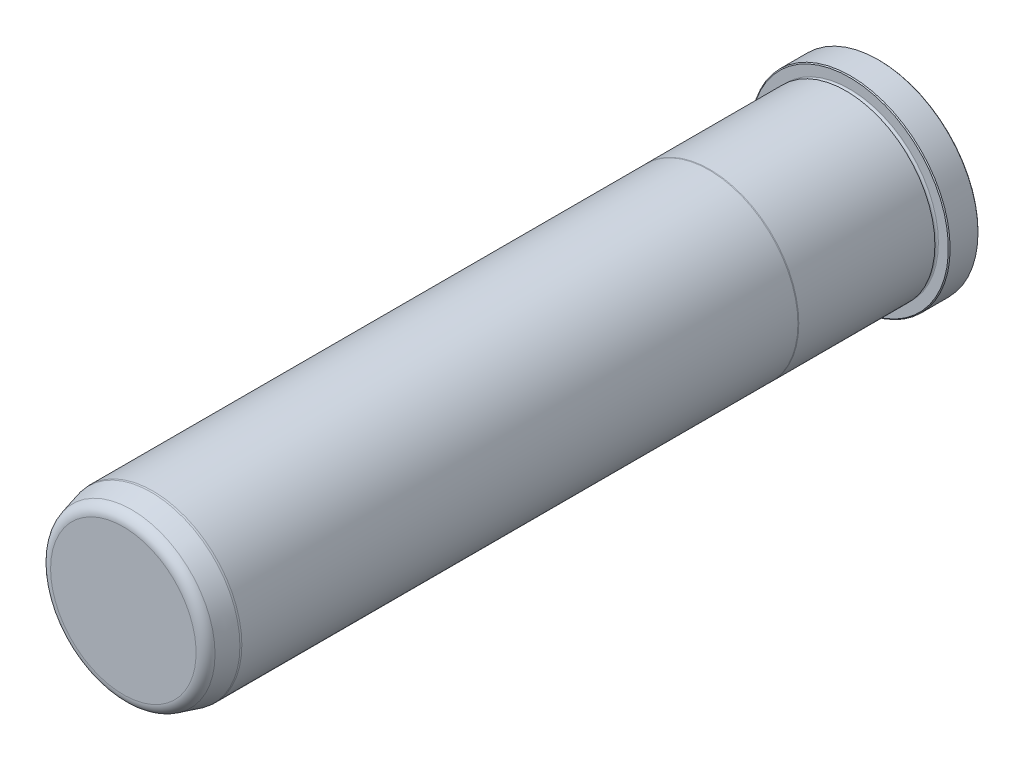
ISO-10303-21;
HEADER;
FILE_DESCRIPTION(('STEP AP214'),'2;1');
FILE_NAME('part.step','',(''),(''),'','','');
FILE_SCHEMA(('AUTOMOTIVE_DESIGN { 1 0 10303 214 1 1 1 1 }'));
ENDSEC;
DATA;
#1=APPLICATION_CONTEXT('core data for automotive mechanical design processes');
#2=APPLICATION_PROTOCOL_DEFINITION('international standard','automotive_design',2000,#1);
#3=PRODUCT_CONTEXT('',#1,'mechanical');
#4=PRODUCT('Part','Part','',(#3));
#5=PRODUCT_RELATED_PRODUCT_CATEGORY('part','',(#4));
#6=PRODUCT_DEFINITION_FORMATION('','',#4);
#7=PRODUCT_DEFINITION_CONTEXT('part definition',#1,'design');
#8=PRODUCT_DEFINITION('design','',#6,#7);
#9=PRODUCT_DEFINITION_SHAPE('','',#8);
#10=(LENGTH_UNIT() NAMED_UNIT(*) SI_UNIT(.MILLI.,.METRE.));
#11=(NAMED_UNIT(*) PLANE_ANGLE_UNIT() SI_UNIT($,.RADIAN.));
#12=(NAMED_UNIT(*) SI_UNIT($,.STERADIAN.) SOLID_ANGLE_UNIT());
#13=UNCERTAINTY_MEASURE_WITH_UNIT(LENGTH_MEASURE(1.E-05),#10,'distance_accuracy_value','');
#14=(GEOMETRIC_REPRESENTATION_CONTEXT(3) GLOBAL_UNCERTAINTY_ASSIGNED_CONTEXT((#13)) GLOBAL_UNIT_ASSIGNED_CONTEXT((#10,
#11,#12)) REPRESENTATION_CONTEXT('',''));
#15=CARTESIAN_POINT('',(0.,0.,0.));
#16=DIRECTION('',(0.,0.,1.));
#17=DIRECTION('',(1.,0.,0.));
#18=AXIS2_PLACEMENT_3D('',#15,#16,#17);
#19=CARTESIAN_POINT('',(0.,0.,0.));
#20=DIRECTION('',(0.,0.,1.));
#21=DIRECTION('',(1.,0.,0.));
#22=AXIS2_PLACEMENT_3D('',#19,#20,#21);
#23=PLANE('',#22);
#24=CARTESIAN_POINT('',(0.,0.,0.));
#25=DIRECTION('',(0.,0.,1.));
#26=DIRECTION('',(1.,0.,0.));
#27=AXIS2_PLACEMENT_3D('',#24,#25,#26);
#28=CIRCLE('',#27,42.3545);
#29=CARTESIAN_POINT('',(42.3545,0.,0.));
#30=VERTEX_POINT('',#29);
#31=EDGE_CURVE('E37',#30,#30,#28,.F.);
#32=ORIENTED_EDGE('',*,*,#31,.T.);
#33=EDGE_LOOP('',(#32));
#34=FACE_BOUND('',#33,.T.);
#35=ADVANCED_FACE('F30',(#34),#23,.F.);
#36=CARTESIAN_POINT('',(0.,0.,0.));
#37=DIRECTION('',(0.,0.,1.));
#38=DIRECTION('',(1.,0.,0.));
#39=AXIS2_PLACEMENT_3D('',#36,#37,#38);
#40=CYLINDRICAL_SURFACE('',#39,42.7355);
#41=CARTESIAN_POINT('',(0.,0.,0.381000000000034));
#42=DIRECTION('',(0.,0.,1.));
#43=DIRECTION('',(1.,0.,0.));
#44=AXIS2_PLACEMENT_3D('',#41,#42,#43);
#45=CIRCLE('',#44,42.7355);
#46=CARTESIAN_POINT('',(42.7355,0.,0.381000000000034));
#47=VERTEX_POINT('',#46);
#48=EDGE_CURVE('E41',#47,#47,#45,.T.);
#49=ORIENTED_EDGE('',*,*,#48,.T.);
#50=EDGE_LOOP('',(#49));
#51=FACE_BOUND('',#50,.T.);
#52=CARTESIAN_POINT('',(0.,0.,12.3190000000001));
#53=DIRECTION('',(0.,0.,-1.));
#54=DIRECTION('',(-1.,0.,0.));
#55=AXIS2_PLACEMENT_3D('',#52,#53,#54);
#56=CIRCLE('',#55,42.7355);
#57=CARTESIAN_POINT('',(-42.7355,0.,12.3190000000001));
#58=VERTEX_POINT('',#57);
#59=EDGE_CURVE('E45',#58,#58,#56,.T.);
#60=ORIENTED_EDGE('',*,*,#59,.T.);
#61=EDGE_LOOP('',(#60));
#62=FACE_BOUND('',#61,.T.);
#63=ADVANCED_FACE('F118',(#51,#62),#40,.T.);
#64=CARTESIAN_POINT('',(0.,42.7355,12.7));
#65=DIRECTION('',(0.,0.,-1.));
#66=DIRECTION('',(-1.,0.,0.));
#67=AXIS2_PLACEMENT_3D('',#64,#65,#66);
#68=PLANE('',#67);
#69=CARTESIAN_POINT('',(0.,0.,12.7));
#70=DIRECTION('',(0.,0.,-1.));
#71=DIRECTION('',(-1.,0.,0.));
#72=AXIS2_PLACEMENT_3D('',#69,#70,#71);
#73=CIRCLE('',#72,42.3545000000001);
#74=CARTESIAN_POINT('',(-42.3545000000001,0.,12.7));
#75=VERTEX_POINT('',#74);
#76=EDGE_CURVE('E10',#75,#75,#73,.F.);
#77=ORIENTED_EDGE('',*,*,#76,.T.);
#78=EDGE_LOOP('',(#77));
#79=FACE_BOUND('',#78,.T.);
#80=CARTESIAN_POINT('',(0.,0.,12.7));
#81=DIRECTION('',(0.,0.,1.));
#82=DIRECTION('',(1.,0.,0.));
#83=AXIS2_PLACEMENT_3D('',#80,#81,#82);
#84=CIRCLE('',#83,38.0873);
#85=CARTESIAN_POINT('',(38.0873,0.,12.7));
#86=VERTEX_POINT('',#85);
#87=EDGE_CURVE('E56',#86,#86,#84,.T.);
#88=ORIENTED_EDGE('',*,*,#87,.F.);
#89=EDGE_LOOP('',(#88));
#90=FACE_BOUND('',#89,.T.);
#91=ADVANCED_FACE('F113',(#79,#90),#68,.F.);
#92=CARTESIAN_POINT('',(0.,0.,13.462));
#93=DIRECTION('',(0.,0.,1.));
#94=DIRECTION('',(1.,0.,0.));
#95=AXIS2_PLACEMENT_3D('',#92,#93,#94);
#96=TOROIDAL_SURFACE('',#95,38.0873,0.762);
#97=CARTESIAN_POINT('',(0.,0.,14.224));
#98=DIRECTION('',(0.,0.,1.));
#99=DIRECTION('',(1.,0.,0.));
#100=AXIS2_PLACEMENT_3D('',#97,#98,#99);
#101=CIRCLE('',#100,38.0873);
#102=CARTESIAN_POINT('',(38.0873,0.,14.224));
#103=VERTEX_POINT('',#102);
#104=EDGE_CURVE('E59',#103,#103,#101,.T.);
#105=ORIENTED_EDGE('',*,*,#104,.F.);
#106=EDGE_LOOP('',(#105));
#107=FACE_BOUND('',#106,.T.);
#108=ORIENTED_EDGE('',*,*,#87,.T.);
#109=EDGE_LOOP('',(#108));
#110=FACE_BOUND('',#109,.T.);
#111=ADVANCED_FACE('F107',(#107,#110),#96,.F.);
#112=CARTESIAN_POINT('',(0.,38.0873,14.224));
#113=DIRECTION('',(0.,0.,1.));
#114=DIRECTION('',(1.,0.,0.));
#115=AXIS2_PLACEMENT_3D('',#112,#113,#114);
#116=PLANE('',#115);
#117=CARTESIAN_POINT('',(0.,0.,14.224));
#118=DIRECTION('',(0.,0.,1.));
#119=DIRECTION('',(1.,0.,0.));
#120=AXIS2_PLACEMENT_3D('',#117,#118,#119);
#121=CIRCLE('',#120,38.1127);
#122=CARTESIAN_POINT('',(38.1127,0.,14.224));
#123=VERTEX_POINT('',#122);
#124=EDGE_CURVE('E62',#123,#123,#121,.T.);
#125=ORIENTED_EDGE('',*,*,#124,.F.);
#126=EDGE_LOOP('',(#125));
#127=FACE_BOUND('',#126,.T.);
#128=ORIENTED_EDGE('',*,*,#104,.T.);
#129=EDGE_LOOP('',(#128));
#130=FACE_BOUND('',#129,.T.);
#131=ADVANCED_FACE('F101',(#127,#130),#116,.F.);
#132=CARTESIAN_POINT('',(0.,0.,0.));
#133=DIRECTION('',(0.,0.,1.));
#134=DIRECTION('',(1.,0.,0.));
#135=AXIS2_PLACEMENT_3D('',#132,#133,#134);
#136=CYLINDRICAL_SURFACE('',#135,38.1127);
#137=CARTESIAN_POINT('',(0.,0.,72.5347630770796));
#138=DIRECTION('',(0.,0.,1.));
#139=DIRECTION('',(1.,0.,0.));
#140=AXIS2_PLACEMENT_3D('',#137,#138,#139);
#141=CIRCLE('',#140,38.1127);
#142=CARTESIAN_POINT('',(38.1127,0.,72.5347630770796));
#143=VERTEX_POINT('',#142);
#144=EDGE_CURVE('E65',#143,#143,#141,.T.);
#145=ORIENTED_EDGE('',*,*,#144,.F.);
#146=EDGE_LOOP('',(#145));
#147=FACE_BOUND('',#146,.T.);
#148=ORIENTED_EDGE('',*,*,#124,.T.);
#149=EDGE_LOOP('',(#148));
#150=FACE_BOUND('',#149,.T.);
#151=ADVANCED_FACE('F95',(#147,#150),#136,.T.);
#152=CARTESIAN_POINT('',(0.,0.,72.5347630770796));
#153=DIRECTION('',(0.,0.,-1.));
#154=DIRECTION('',(-1.,0.,0.));
#155=AXIS2_PLACEMENT_3D('',#152,#153,#154);
#156=CONICAL_SURFACE('',#155,38.1127,0.0698131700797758);
#157=CARTESIAN_POINT('',(0.,0.,72.898));
#158=DIRECTION('',(0.,0.,1.));
#159=DIRECTION('',(1.,0.,0.));
#160=AXIS2_PLACEMENT_3D('',#157,#158,#159);
#161=CIRCLE('',#160,38.0873);
#162=CARTESIAN_POINT('',(38.0873,0.,72.898));
#163=VERTEX_POINT('',#162);
#164=EDGE_CURVE('E68',#163,#163,#161,.T.);
#165=ORIENTED_EDGE('',*,*,#164,.F.);
#166=EDGE_LOOP('',(#165));
#167=FACE_BOUND('',#166,.T.);
#168=ORIENTED_EDGE('',*,*,#144,.T.);
#169=EDGE_LOOP('',(#168));
#170=FACE_BOUND('',#169,.T.);
#171=ADVANCED_FACE('F89',(#167,#170),#156,.T.);
#172=CARTESIAN_POINT('',(0.,0.,0.));
#173=DIRECTION('',(0.,0.,1.));
#174=DIRECTION('',(1.,0.,0.));
#175=AXIS2_PLACEMENT_3D('',#172,#173,#174);
#176=CYLINDRICAL_SURFACE('',#175,38.0873);
#177=CARTESIAN_POINT('',(0.,0.,311.15));
#178=DIRECTION('',(0.,0.,1.));
#179=DIRECTION('',(1.,0.,0.));
#180=AXIS2_PLACEMENT_3D('',#177,#178,#179);
#181=CIRCLE('',#180,38.0873);
#182=CARTESIAN_POINT('',(38.0873,0.,311.15));
#183=VERTEX_POINT('',#182);
#184=EDGE_CURVE('E71',#183,#183,#181,.T.);
#185=ORIENTED_EDGE('',*,*,#184,.F.);
#186=EDGE_LOOP('',(#185));
#187=FACE_BOUND('',#186,.T.);
#188=ORIENTED_EDGE('',*,*,#164,.T.);
#189=EDGE_LOOP('',(#188));
#190=FACE_BOUND('',#189,.T.);
#191=ADVANCED_FACE('F83',(#187,#190),#176,.T.);
#192=CARTESIAN_POINT('',(0.,0.,311.15));
#193=DIRECTION('',(0.,0.,-1.));
#194=DIRECTION('',(-1.,0.,0.));
#195=AXIS2_PLACEMENT_3D('',#192,#193,#194);
#196=CONICAL_SURFACE('',#195,38.0873,0.0872664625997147);
#197=CARTESIAN_POINT('',(0.,0.,311.912));
#198=DIRECTION('',(0.,0.,1.));
#199=DIRECTION('',(1.,0.,0.));
#200=AXIS2_PLACEMENT_3D('',#197,#198,#199);
#201=CIRCLE('',#200,38.0206336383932);
#202=CARTESIAN_POINT('',(38.0206336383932,0.,311.912));
#203=VERTEX_POINT('',#202);
#204=EDGE_CURVE('E74',#203,#203,#201,.T.);
#205=ORIENTED_EDGE('',*,*,#204,.F.);
#206=EDGE_LOOP('',(#205));
#207=FACE_BOUND('',#206,.T.);
#208=ORIENTED_EDGE('',*,*,#184,.T.);
#209=EDGE_LOOP('',(#208));
#210=FACE_BOUND('',#209,.T.);
#211=ADVANCED_FACE('F80',(#207,#210),#196,.T.);
#212=CARTESIAN_POINT('',(0.,0.,311.912));
#213=DIRECTION('',(0.,0.,-1.));
#214=DIRECTION('',(-1.,0.,0.));
#215=AXIS2_PLACEMENT_3D('',#212,#213,#214);
#216=CONICAL_SURFACE('',#215,38.0206336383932,0.26179938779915);
#217=CARTESIAN_POINT('',(0.,0.,320.320125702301));
#218=DIRECTION('',(0.,0.,1.));
#219=DIRECTION('',(1.,0.,0.));
#220=AXIS2_PLACEMENT_3D('',#217,#218,#219);
#221=CIRCLE('',#220,35.7676831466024);
#222=CARTESIAN_POINT('',(35.7676831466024,0.,320.320125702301));
#223=VERTEX_POINT('',#222);
#224=EDGE_CURVE('E50',#223,#223,#221,.F.);
#225=ORIENTED_EDGE('',*,*,#224,.T.);
#226=EDGE_LOOP('',(#225));
#227=FACE_BOUND('',#226,.T.);
#228=ORIENTED_EDGE('',*,*,#204,.T.);
#229=EDGE_LOOP('',(#228));
#230=FACE_BOUND('',#229,.T.);
#231=ADVANCED_FACE('F78',(#227,#230),#216,.T.);
#232=CARTESIAN_POINT('',(0.,34.8218561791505,323.85));
#233=DIRECTION('',(0.,0.,-1.));
#234=DIRECTION('',(-1.,0.,0.));
#235=AXIS2_PLACEMENT_3D('',#232,#233,#234);
#236=PLANE('',#235);
#237=CARTESIAN_POINT('',(0.,0.,323.85));
#238=DIRECTION('',(0.,0.,-1.));
#239=DIRECTION('',(-1.,0.,0.));
#240=AXIS2_PLACEMENT_3D('',#237,#238,#239);
#241=CIRCLE('',#240,31.1674613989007);
#242=CARTESIAN_POINT('',(-31.1674613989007,0.,323.85));
#243=VERTEX_POINT('',#242);
#244=EDGE_CURVE('E53',#243,#243,#241,.F.);
#245=ORIENTED_EDGE('',*,*,#244,.T.);
#246=EDGE_LOOP('',(#245));
#247=FACE_BOUND('',#246,.T.);
#248=ADVANCED_FACE('F133',(#247),#236,.F.);
#249=CARTESIAN_POINT('',(0.,0.,319.0875));
#250=DIRECTION('',(0.,0.,-1.));
#251=DIRECTION('',(-1.,0.,0.));
#252=AXIS2_PLACEMENT_3D('',#249,#250,#251);
#253=TOROIDAL_SURFACE('',#252,31.1674613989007,4.7625);
#254=ORIENTED_EDGE('',*,*,#224,.F.);
#255=EDGE_LOOP('',(#254));
#256=FACE_BOUND('',#255,.T.);
#257=ORIENTED_EDGE('',*,*,#244,.F.);
#258=EDGE_LOOP('',(#257));
#259=FACE_BOUND('',#258,.T.);
#260=ADVANCED_FACE('F130',(#256,#259),#253,.T.);
#261=CARTESIAN_POINT('',(0.,0.,0.381000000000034));
#262=DIRECTION('',(0.,0.,1.));
#263=DIRECTION('',(1.,0.,0.));
#264=AXIS2_PLACEMENT_3D('',#261,#262,#263);
#265=CONICAL_SURFACE('',#264,42.7355,0.785398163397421);
#266=ORIENTED_EDGE('',*,*,#31,.F.);
#267=EDGE_LOOP('',(#266));
#268=FACE_BOUND('',#267,.T.);
#269=ORIENTED_EDGE('',*,*,#48,.F.);
#270=EDGE_LOOP('',(#269));
#271=FACE_BOUND('',#270,.T.);
#272=ADVANCED_FACE('F132',(#268,#271),#265,.T.);
#273=CARTESIAN_POINT('',(0.,0.,12.7));
#274=DIRECTION('',(0.,0.,-1.));
#275=DIRECTION('',(-1.,0.,0.));
#276=AXIS2_PLACEMENT_3D('',#273,#274,#275);
#277=CONICAL_SURFACE('',#276,42.3545000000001,0.785398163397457);
#278=ORIENTED_EDGE('',*,*,#59,.F.);
#279=EDGE_LOOP('',(#278));
#280=FACE_BOUND('',#279,.T.);
#281=ORIENTED_EDGE('',*,*,#76,.F.);
#282=EDGE_LOOP('',(#281));
#283=FACE_BOUND('',#282,.T.);
#284=ADVANCED_FACE('F32',(#280,#283),#277,.T.);
#285=CLOSED_SHELL('',(#35,#63,#91,#111,#131,#151,#171,#191,#211,#231,#248,#260,#272,#284));
#286=MANIFOLD_SOLID_BREP('B2',#285);
#287=ADVANCED_BREP_SHAPE_REPRESENTATION('',(#18,#286),#14);
#288=SHAPE_DEFINITION_REPRESENTATION(#9,#287);
ENDSEC;
END-ISO-10303-21;
